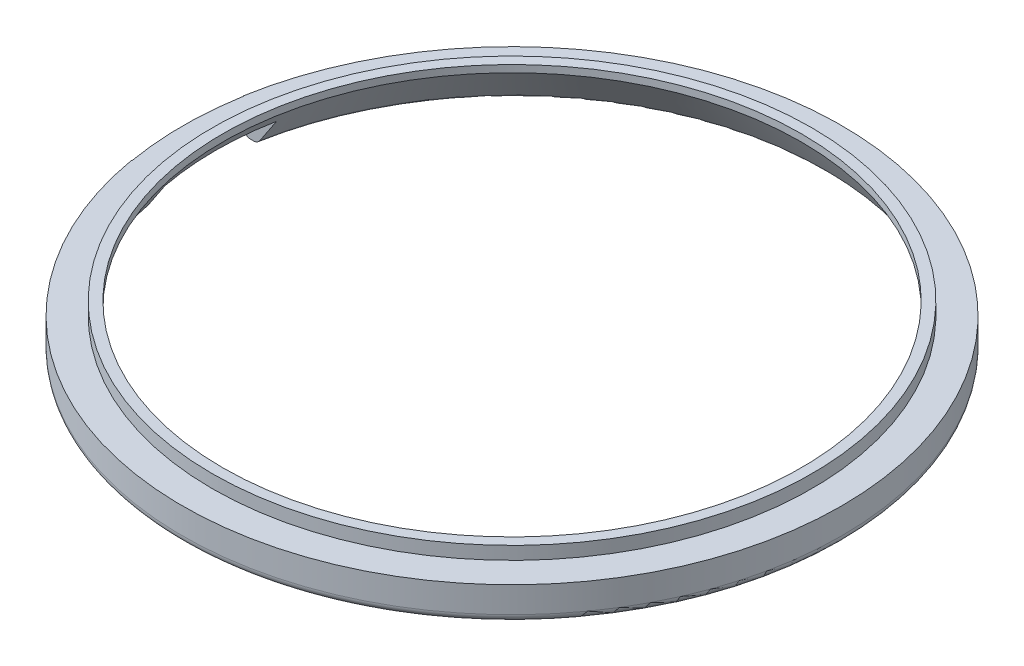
ISO-10303-21;
HEADER;
FILE_DESCRIPTION(('STEP AP214'),'2;1');
FILE_NAME('part.step','',(''),(''),'','','');
FILE_SCHEMA(('AUTOMOTIVE_DESIGN { 1 0 10303 214 1 1 1 1 }'));
ENDSEC;
DATA;
#1=APPLICATION_CONTEXT('core data for automotive mechanical design processes');
#2=APPLICATION_PROTOCOL_DEFINITION('international standard','automotive_design',2000,#1);
#3=PRODUCT_CONTEXT('',#1,'mechanical');
#4=PRODUCT('Part','Part','',(#3));
#5=PRODUCT_RELATED_PRODUCT_CATEGORY('part','',(#4));
#6=PRODUCT_DEFINITION_FORMATION('','',#4);
#7=PRODUCT_DEFINITION_CONTEXT('part definition',#1,'design');
#8=PRODUCT_DEFINITION('design','',#6,#7);
#9=PRODUCT_DEFINITION_SHAPE('','',#8);
#10=(LENGTH_UNIT() NAMED_UNIT(*) SI_UNIT(.MILLI.,.METRE.));
#11=(NAMED_UNIT(*) PLANE_ANGLE_UNIT() SI_UNIT($,.RADIAN.));
#12=(NAMED_UNIT(*) SI_UNIT($,.STERADIAN.) SOLID_ANGLE_UNIT());
#13=UNCERTAINTY_MEASURE_WITH_UNIT(LENGTH_MEASURE(1.E-05),#10,'distance_accuracy_value','');
#14=(GEOMETRIC_REPRESENTATION_CONTEXT(3) GLOBAL_UNCERTAINTY_ASSIGNED_CONTEXT((#13)) GLOBAL_UNIT_ASSIGNED_CONTEXT((#10,
#11,#12)) REPRESENTATION_CONTEXT('',''));
#15=CARTESIAN_POINT('',(0.,0.,0.));
#16=DIRECTION('',(0.,0.,1.));
#17=DIRECTION('',(1.,0.,0.));
#18=AXIS2_PLACEMENT_3D('',#15,#16,#17);
#19=CARTESIAN_POINT('',(0.,1.8,0.));
#20=DIRECTION('',(0.,1.,0.));
#21=DIRECTION('',(0.,0.,1.));
#22=AXIS2_PLACEMENT_3D('',#19,#20,#21);
#23=PLANE('',#22);
#24=CARTESIAN_POINT('',(0.,1.8,0.));
#25=DIRECTION('',(0.,1.,0.));
#26=DIRECTION('',(0.,0.,1.));
#27=AXIS2_PLACEMENT_3D('',#24,#25,#26);
#28=CIRCLE('',#27,11.15);
#29=CARTESIAN_POINT('',(0.,1.8,11.15));
#30=VERTEX_POINT('',#29);
#31=EDGE_CURVE('E248',#30,#30,#28,.T.);
#32=ORIENTED_EDGE('',*,*,#31,.F.);
#33=EDGE_LOOP('',(#32));
#34=FACE_BOUND('',#33,.T.);
#35=CARTESIAN_POINT('',(0.,1.8,0.));
#36=DIRECTION('',(0.,1.,0.));
#37=DIRECTION('',(0.,0.,1.));
#38=AXIS2_PLACEMENT_3D('',#35,#36,#37);
#39=CIRCLE('',#38,11.55);
#40=CARTESIAN_POINT('',(0.,1.8,11.55));
#41=VERTEX_POINT('',#40);
#42=EDGE_CURVE('E341',#41,#41,#39,.T.);
#43=ORIENTED_EDGE('',*,*,#42,.T.);
#44=EDGE_LOOP('',(#43));
#45=FACE_BOUND('',#44,.T.);
#46=ADVANCED_FACE('F34',(#34,#45),#23,.T.);
#47=CARTESIAN_POINT('',(0.,1.8,0.));
#48=DIRECTION('',(0.,-1.,0.));
#49=DIRECTION('',(0.,0.,-1.));
#50=AXIS2_PLACEMENT_3D('',#47,#48,#49);
#51=CYLINDRICAL_SURFACE('',#50,12.7);
#52=CARTESIAN_POINT('',(0.,1.3,0.));
#53=DIRECTION('',(0.,1.,0.));
#54=DIRECTION('',(0.,0.,1.));
#55=AXIS2_PLACEMENT_3D('',#52,#53,#54);
#56=CIRCLE('',#55,12.7);
#57=CARTESIAN_POINT('',(-12.516688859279,1.3,2.15));
#58=VERTEX_POINT('',#57);
#59=CARTESIAN_POINT('',(-12.516688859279,1.3,-2.15));
#60=VERTEX_POINT('',#59);
#61=EDGE_CURVE('E254',#58,#60,#56,.T.);
#62=ORIENTED_EDGE('',*,*,#61,.F.);
#63=DIRECTION('',(0.,-1.,0.));
#64=VECTOR('',#63,1.);
#65=CARTESIAN_POINT('',(-12.516688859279,1.8,2.15));
#66=LINE('',#65,#64);
#67=CARTESIAN_POINT('',(-12.516688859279,0.3,2.15));
#68=VERTEX_POINT('',#67);
#69=EDGE_CURVE('E111',#58,#68,#66,.T.);
#70=ORIENTED_EDGE('',*,*,#69,.T.);
#71=CARTESIAN_POINT('',(0.,0.3,0.));
#72=DIRECTION('',(0.,1.,0.));
#73=DIRECTION('',(0.,0.,1.));
#74=AXIS2_PLACEMENT_3D('',#71,#72,#73);
#75=CIRCLE('',#74,12.7);
#76=CARTESIAN_POINT('',(-12.516688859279,0.3,-2.15));
#77=VERTEX_POINT('',#76);
#78=EDGE_CURVE('E173',#68,#77,#75,.T.);
#79=ORIENTED_EDGE('',*,*,#78,.T.);
#80=DIRECTION('',(0.,-1.,0.));
#81=VECTOR('',#80,1.);
#82=CARTESIAN_POINT('',(-12.516688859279,1.8,-2.15));
#83=LINE('',#82,#81);
#84=EDGE_CURVE('E245',#77,#60,#83,.F.);
#85=ORIENTED_EDGE('',*,*,#84,.T.);
#86=EDGE_LOOP('',(#62,#70,#79,#85));
#87=FACE_BOUND('',#86,.T.);
#88=ADVANCED_FACE('F138',(#87),#51,.T.);
#89=CARTESIAN_POINT('',(-12.7,0.,-2.15));
#90=DIRECTION('',(0.,0.,-1.));
#91=DIRECTION('',(0.,1.,0.));
#92=AXIS2_PLACEMENT_3D('',#89,#90,#91);
#93=PLANE('',#92);
#94=DIRECTION('',(1.,0.,0.));
#95=VECTOR('',#94,1.);
#96=CARTESIAN_POINT('',(-12.7,1.3,-2.15));
#97=LINE('',#96,#95);
#98=CARTESIAN_POINT('',(-12.4992799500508,1.29999999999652,-2.15));
#99=VERTEX_POINT('',#98);
#100=EDGE_CURVE('E50',#60,#99,#97,.T.);
#101=ORIENTED_EDGE('',*,*,#100,.F.);
#102=ORIENTED_EDGE('',*,*,#84,.F.);
#103=CARTESIAN_POINT('',(-12.516688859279,0.3,-2.15));
#104=CARTESIAN_POINT('',(-12.516704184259,0.283300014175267,-2.15));
#105=CARTESIAN_POINT('',(-12.51527494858,0.266605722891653,-2.15));
#106=CARTESIAN_POINT('',(-12.5096421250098,0.233711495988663,-2.15));
#107=CARTESIAN_POINT('',(-12.5054418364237,0.217510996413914,-2.15));
#108=CARTESIAN_POINT('',(-12.4943792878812,0.186040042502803,-2.15));
#109=CARTESIAN_POINT('',(-12.4875161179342,0.170769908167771,-2.15));
#110=CARTESIAN_POINT('',(-12.4713406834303,0.141589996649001,-2.15));
#111=CARTESIAN_POINT('',(-12.4620285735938,0.127680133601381,-2.15));
#112=CARTESIAN_POINT('',(-12.4411637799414,0.101515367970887,-2.15));
#113=CARTESIAN_POINT('',(-12.4295975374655,0.0892712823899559,-2.15));
#114=CARTESIAN_POINT('',(-12.4045962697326,0.0668646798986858,-2.15));
#115=CARTESIAN_POINT('',(-12.3911608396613,0.0567026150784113,-2.15));
#116=CARTESIAN_POINT('',(-12.3626072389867,0.0386007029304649,-2.15));
#117=CARTESIAN_POINT('',(-12.3474683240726,0.0306936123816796,-2.15));
#118=CARTESIAN_POINT('',(-12.3160921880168,0.0174974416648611,-2.15));
#119=CARTESIAN_POINT('',(-12.2998553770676,0.0122073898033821,-2.15));
#120=CARTESIAN_POINT('',(-12.2716532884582,0.00553607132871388,-2.15));
#121=CARTESIAN_POINT('',(-12.2598470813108,0.00346117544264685,-2.15));
#122=CARTESIAN_POINT('',(-12.2360908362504,0.000693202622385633,-2.15));
#123=CARTESIAN_POINT('',(-12.224141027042,-1.83742113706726E-06,-2.15));
#124=CARTESIAN_POINT('',(-12.212186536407,0.,-2.15));
#125=B_SPLINE_CURVE_WITH_KNOTS('',3,(#103,#104,#105,#106,#107,#108,#109,#110,#111,#112,#113,
#114,#115,#116,#117,#118,#119,#120,#121,#122,#123,#124),.UNSPECIFIED.,.F.,.F.,(4,2,2,2,2,2,2,2,
2,2,4),(0.,0.0500304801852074,0.10000149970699,0.149989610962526,0.199974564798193,
0.250270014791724,0.300576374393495,0.351580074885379,0.402564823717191,0.438450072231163,
0.474284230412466),.UNSPECIFIED.);
#126=CARTESIAN_POINT('',(-12.212186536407,0.,-2.15));
#127=VERTEX_POINT('',#126);
#128=EDGE_CURVE('E148',#77,#127,#125,.T.);
#129=ORIENTED_EDGE('',*,*,#128,.T.);
#130=DIRECTION('',(1.,0.,0.));
#131=VECTOR('',#130,1.);
#132=CARTESIAN_POINT('',(-12.7,0.,-2.15));
#133=LINE('',#132,#131);
#134=CARTESIAN_POINT('',(-12.1228641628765,0.,-2.15));
#135=VERTEX_POINT('',#134);
#136=EDGE_CURVE('E202',#127,#135,#133,.T.);
#137=ORIENTED_EDGE('',*,*,#136,.T.);
#138=CARTESIAN_POINT('',(-12.1228641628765,0.,-2.15));
#139=CARTESIAN_POINT('',(-12.1055158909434,-1.3442783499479E-05,-2.15));
#140=CARTESIAN_POINT('',(-12.0881703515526,0.00145816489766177,-2.15));
#141=CARTESIAN_POINT('',(-12.0539781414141,0.0072722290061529,-2.15));
#142=CARTESIAN_POINT('',(-12.0371311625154,0.0116128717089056,-2.15));
#143=CARTESIAN_POINT('',(-12.0043912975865,0.0230712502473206,-2.15));
#144=CARTESIAN_POINT('',(-11.9884993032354,0.0301915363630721,-2.15));
#145=CARTESIAN_POINT('',(-11.9581547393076,0.0470129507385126,-2.15));
#146=CARTESIAN_POINT('',(-11.9437013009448,0.056712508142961,-2.15));
#147=CARTESIAN_POINT('',(-11.9181712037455,0.0772170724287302,-2.15));
#148=CARTESIAN_POINT('',(-11.9068977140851,0.0877780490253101,-2.15));
#149=CARTESIAN_POINT('',(-11.8860743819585,0.110503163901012,-2.15));
#150=CARTESIAN_POINT('',(-11.8765266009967,0.122669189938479,-2.15));
#151=CARTESIAN_POINT('',(-11.8679798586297,0.135512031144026,-2.15));
#152=B_SPLINE_CURVE_WITH_KNOTS('',3,(#138,#139,#140,#141,#142,#143,#144,#145,#146,#147,#148,
#149,#150,#151),.UNSPECIFIED.,.F.,.F.,(4,2,2,2,2,2,4),(0.,0.051979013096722,0.103925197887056,
0.155919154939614,0.207881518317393,0.25404713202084,0.300267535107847),.UNSPECIFIED.);
#153=CARTESIAN_POINT('',(-11.8679798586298,0.13551203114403,-2.15));
#154=VERTEX_POINT('',#153);
#155=EDGE_CURVE('E168',#135,#154,#152,.T.);
#156=ORIENTED_EDGE('',*,*,#155,.T.);
#157=CARTESIAN_POINT('',(-13.5695185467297,-2.42330652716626,-2.15));
#158=CARTESIAN_POINT('',(-13.2928045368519,-2.00645330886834,-2.15));
#159=CARTESIAN_POINT('',(-13.0159518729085,-1.58969205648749,-2.15));
#160=CARTESIAN_POINT('',(-12.4618982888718,-0.756401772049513,-2.15));
#161=CARTESIAN_POINT('',(-12.1846973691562,-0.339872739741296,-2.15));
#162=CARTESIAN_POINT('',(-11.6298756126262,0.492905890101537,-2.15));
#163=CARTESIAN_POINT('',(-11.3522547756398,0.909155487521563,-2.15));
#164=CARTESIAN_POINT('',(-10.7964844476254,1.74130222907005,-2.15));
#165=CARTESIAN_POINT('',(-10.5183349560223,2.15719937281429,-2.15));
#166=CARTESIAN_POINT('',(-10.2398670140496,2.57288341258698,-2.15));
#167=B_SPLINE_CURVE_WITH_KNOTS('',3,(#157,#158,#159,#160,#161,#162,#163,#164,#165,#166),
.UNSPECIFIED.,.F.,.F.,(4,2,2,2,4),(0.,1.50101146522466,3.00202130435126,4.50303175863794,
6.00404384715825),.UNSPECIFIED.);
#168=CARTESIAN_POINT('',(-11.2247566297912,1.1,-2.15));
#169=VERTEX_POINT('',#168);
#170=EDGE_CURVE('E189',#154,#169,#167,.T.);
#171=ORIENTED_EDGE('',*,*,#170,.T.);
#172=DIRECTION('',(1.,0.,0.));
#173=VECTOR('',#172,1.);
#174=CARTESIAN_POINT('',(-12.7,1.1,-2.15));
#175=LINE('',#174,#173);
#176=CARTESIAN_POINT('',(-12.212186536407,1.1,-2.15));
#177=VERTEX_POINT('',#176);
#178=EDGE_CURVE('E196',#177,#169,#175,.T.);
#179=ORIENTED_EDGE('',*,*,#178,.F.);
#180=CARTESIAN_POINT('',(-12.212186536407,1.1,-2.15));
#181=CARTESIAN_POINT('',(-12.2295086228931,1.09998650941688,-2.15));
#182=CARTESIAN_POINT('',(-12.2468281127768,1.10145441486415,-2.15));
#183=CARTESIAN_POINT('',(-12.2809746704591,1.10725666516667,-2.15));
#184=CARTESIAN_POINT('',(-12.2978018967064,1.11159007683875,-2.15));
#185=CARTESIAN_POINT('',(-12.3304991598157,1.12303079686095,-2.15));
#186=CARTESIAN_POINT('',(-12.3463685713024,1.1301398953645,-2.15));
#187=CARTESIAN_POINT('',(-12.3766724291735,1.14693780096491,-2.15));
#188=CARTESIAN_POINT('',(-12.3911073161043,1.15662581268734,-2.15));
#189=CARTESIAN_POINT('',(-12.4180177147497,1.17824052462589,-2.15));
#190=CARTESIAN_POINT('',(-12.4305067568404,1.19015037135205,-2.15));
#191=CARTESIAN_POINT('',(-12.4532757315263,1.21592791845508,-2.15));
#192=CARTESIAN_POINT('',(-12.4635552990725,1.22979594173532,-2.15));
#193=CARTESIAN_POINT('',(-12.4814553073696,1.25888345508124,-2.15));
#194=CARTESIAN_POINT('',(-12.4891109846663,1.27408128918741,-2.15));
#195=CARTESIAN_POINT('',(-12.5017191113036,1.30555394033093,-2.15));
#196=CARTESIAN_POINT('',(-12.5066737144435,1.32182788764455,-2.15));
#197=CARTESIAN_POINT('',(-12.5123578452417,1.34851963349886,-2.15));
#198=CARTESIAN_POINT('',(-12.5139810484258,1.35875550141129,-2.15));
#199=CARTESIAN_POINT('',(-12.5161462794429,1.37932600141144,-2.15));
#200=CARTESIAN_POINT('',(-12.5166898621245,1.38966046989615,-2.15));
#201=CARTESIAN_POINT('',(-12.5166888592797,1.39999999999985,-2.15));
#202=B_SPLINE_CURVE_WITH_KNOTS('',3,(#180,#181,#182,#183,#184,#185,#186,#187,#188,#189,#190,
#191,#192,#193,#194,#195,#196,#197,#198,#199,#200,#201),.UNSPECIFIED.,.F.,.F.,(4,2,2,2,2,2,2,2,
2,2,4),(0.,0.0519007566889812,0.103784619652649,0.155702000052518,0.207603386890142,
0.259126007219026,0.31065713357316,0.361466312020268,0.412234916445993,0.443274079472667,
0.47426850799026),.UNSPECIFIED.);
#203=EDGE_CURVE('E43',#177,#99,#202,.T.);
#204=ORIENTED_EDGE('',*,*,#203,.T.);
#205=EDGE_LOOP('',(#101,#102,#129,#137,#156,#171,#179,#204));
#206=FACE_BOUND('',#205,.T.);
#207=ADVANCED_FACE('F179',(#206),#93,.F.);
#208=CARTESIAN_POINT('',(-12.7,0.,2.15));
#209=DIRECTION('',(0.,0.,1.));
#210=DIRECTION('',(0.,-1.,0.));
#211=AXIS2_PLACEMENT_3D('',#208,#209,#210);
#212=PLANE('',#211);
#213=DIRECTION('',(-1.,0.,0.));
#214=VECTOR('',#213,1.);
#215=CARTESIAN_POINT('',(-12.7,1.3,2.15));
#216=LINE('',#215,#214);
#217=CARTESIAN_POINT('',(-12.4992799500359,1.3,2.15));
#218=VERTEX_POINT('',#217);
#219=EDGE_CURVE('E99',#218,#58,#216,.T.);
#220=ORIENTED_EDGE('',*,*,#219,.F.);
#221=CARTESIAN_POINT('',(-12.516688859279,1.4,2.15));
#222=CARTESIAN_POINT('',(-12.516704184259,1.38330001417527,2.15));
#223=CARTESIAN_POINT('',(-12.51527494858,1.36660572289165,2.15));
#224=CARTESIAN_POINT('',(-12.5096421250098,1.33371149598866,2.15));
#225=CARTESIAN_POINT('',(-12.5054418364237,1.31751099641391,2.15));
#226=CARTESIAN_POINT('',(-12.4943792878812,1.2860400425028,2.15));
#227=CARTESIAN_POINT('',(-12.4875161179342,1.27076990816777,2.15));
#228=CARTESIAN_POINT('',(-12.4713406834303,1.241589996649,2.15));
#229=CARTESIAN_POINT('',(-12.4620285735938,1.22768013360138,2.15));
#230=CARTESIAN_POINT('',(-12.4411637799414,1.20151536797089,2.15));
#231=CARTESIAN_POINT('',(-12.4295975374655,1.18927128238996,2.15));
#232=CARTESIAN_POINT('',(-12.4045962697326,1.16686467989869,2.15));
#233=CARTESIAN_POINT('',(-12.3911608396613,1.15670261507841,2.15));
#234=CARTESIAN_POINT('',(-12.3626072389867,1.13860070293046,2.15));
#235=CARTESIAN_POINT('',(-12.3474683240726,1.13069361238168,2.15));
#236=CARTESIAN_POINT('',(-12.3160921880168,1.11749744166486,2.15));
#237=CARTESIAN_POINT('',(-12.2998553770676,1.11220738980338,2.15));
#238=CARTESIAN_POINT('',(-12.2716532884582,1.10553607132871,2.15));
#239=CARTESIAN_POINT('',(-12.2598470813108,1.10346117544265,2.15));
#240=CARTESIAN_POINT('',(-12.2360908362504,1.10069320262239,2.15));
#241=CARTESIAN_POINT('',(-12.224141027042,1.09999816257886,2.15));
#242=CARTESIAN_POINT('',(-12.212186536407,1.1,2.15));
#243=B_SPLINE_CURVE_WITH_KNOTS('',3,(#221,#222,#223,#224,#225,#226,#227,#228,#229,#230,#231,
#232,#233,#234,#235,#236,#237,#238,#239,#240,#241,#242),.UNSPECIFIED.,.F.,.F.,(4,2,2,2,2,2,2,2,
2,2,4),(0.,0.050030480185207,0.100001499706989,0.149989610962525,0.199974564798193,
0.250270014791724,0.300576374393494,0.351580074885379,0.402564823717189,0.438450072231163,
0.474284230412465),.UNSPECIFIED.);
#244=CARTESIAN_POINT('',(-12.212186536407,1.1,2.15));
#245=VERTEX_POINT('',#244);
#246=EDGE_CURVE('E108',#218,#245,#243,.T.);
#247=ORIENTED_EDGE('',*,*,#246,.T.);
#248=DIRECTION('',(1.,0.,0.));
#249=VECTOR('',#248,1.);
#250=CARTESIAN_POINT('',(-12.7,1.1,2.15));
#251=LINE('',#250,#249);
#252=CARTESIAN_POINT('',(-11.2247566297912,1.1,2.15));
#253=VERTEX_POINT('',#252);
#254=EDGE_CURVE('E239',#245,#253,#251,.T.);
#255=ORIENTED_EDGE('',*,*,#254,.T.);
#256=CARTESIAN_POINT('',(-10.2398670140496,2.57288341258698,2.15));
#257=CARTESIAN_POINT('',(-10.5183349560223,2.15719937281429,2.15));
#258=CARTESIAN_POINT('',(-10.7964844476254,1.74130222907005,2.15));
#259=CARTESIAN_POINT('',(-11.3522547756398,0.909155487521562,2.15));
#260=CARTESIAN_POINT('',(-11.6298756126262,0.492905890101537,2.15));
#261=CARTESIAN_POINT('',(-12.1846973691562,-0.339872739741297,2.15));
#262=CARTESIAN_POINT('',(-12.4618982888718,-0.756401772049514,2.15));
#263=CARTESIAN_POINT('',(-13.0159518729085,-1.5896920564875,2.15));
#264=CARTESIAN_POINT('',(-13.2928045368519,-2.00645330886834,2.15));
#265=CARTESIAN_POINT('',(-13.5695185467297,-2.42330652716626,2.15));
#266=B_SPLINE_CURVE_WITH_KNOTS('',3,(#256,#257,#258,#259,#260,#261,#262,#263,#264,#265),
.UNSPECIFIED.,.F.,.F.,(4,2,2,2,4),(0.,1.50101208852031,3.00202254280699,4.50303238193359,
6.00404384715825),.UNSPECIFIED.);
#267=CARTESIAN_POINT('',(-11.8679798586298,0.135512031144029,2.15));
#268=VERTEX_POINT('',#267);
#269=EDGE_CURVE('E197',#253,#268,#266,.T.);
#270=ORIENTED_EDGE('',*,*,#269,.T.);
#271=CARTESIAN_POINT('',(-11.8679798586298,0.135512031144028,2.15000000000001));
#272=CARTESIAN_POINT('',(-11.8774356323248,0.121294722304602,2.15));
#273=CARTESIAN_POINT('',(-11.8881241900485,0.107909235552,2.15));
#274=CARTESIAN_POINT('',(-11.9115747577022,0.0831475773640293,2.15));
#275=CARTESIAN_POINT('',(-11.9243325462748,0.0717674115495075,2.15));
#276=CARTESIAN_POINT('',(-11.9515753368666,0.0512985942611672,2.15));
#277=CARTESIAN_POINT('',(-11.9660609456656,0.0422107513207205,2.15));
#278=CARTESIAN_POINT('',(-11.9963415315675,0.0265620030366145,2.15));
#279=CARTESIAN_POINT('',(-12.0121367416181,0.0200015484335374,2.15));
#280=CARTESIAN_POINT('',(-12.0436011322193,0.00989858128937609,2.15));
#281=CARTESIAN_POINT('',(-12.0592194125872,0.00619661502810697,2.15));
#282=CARTESIAN_POINT('',(-12.0908452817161,0.00124232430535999,2.15));
#283=CARTESIAN_POINT('',(-12.1068530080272,-9.12154720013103E-06,2.15));
#284=CARTESIAN_POINT('',(-12.1228641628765,0.,2.15));
#285=B_SPLINE_CURVE_WITH_KNOTS('',3,(#271,#272,#273,#274,#275,#276,#277,#278,#279,#280,#281,
#282,#283,#284),.UNSPECIFIED.,.F.,.F.,(4,2,2,2,2,2,4),(0.,0.0511479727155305,0.102192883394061,
0.153255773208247,0.20432776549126,0.252289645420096,0.300268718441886),.UNSPECIFIED.);
#286=CARTESIAN_POINT('',(-12.1228641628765,0.,2.15));
#287=VERTEX_POINT('',#286);
#288=EDGE_CURVE('E57',#268,#287,#285,.T.);
#289=ORIENTED_EDGE('',*,*,#288,.T.);
#290=DIRECTION('',(1.,0.,0.));
#291=VECTOR('',#290,1.);
#292=CARTESIAN_POINT('',(-12.7,0.,2.15));
#293=LINE('',#292,#291);
#294=CARTESIAN_POINT('',(-12.212186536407,0.,2.15));
#295=VERTEX_POINT('',#294);
#296=EDGE_CURVE('E234',#295,#287,#293,.T.);
#297=ORIENTED_EDGE('',*,*,#296,.F.);
#298=CARTESIAN_POINT('',(-12.212186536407,0.,2.15));
#299=CARTESIAN_POINT('',(-12.2295086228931,-1.3490583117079E-05,2.15));
#300=CARTESIAN_POINT('',(-12.2468281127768,0.00145441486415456,2.15));
#301=CARTESIAN_POINT('',(-12.2809746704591,0.00725666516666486,2.15));
#302=CARTESIAN_POINT('',(-12.2978018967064,0.0115900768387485,2.15));
#303=CARTESIAN_POINT('',(-12.3304991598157,0.0230307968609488,2.15));
#304=CARTESIAN_POINT('',(-12.3463685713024,0.0301398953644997,2.15));
#305=CARTESIAN_POINT('',(-12.3766724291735,0.0469378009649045,2.15));
#306=CARTESIAN_POINT('',(-12.3911073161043,0.0566258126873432,2.15));
#307=CARTESIAN_POINT('',(-12.4180177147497,0.0782405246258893,2.15));
#308=CARTESIAN_POINT('',(-12.4305067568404,0.0901503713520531,2.15));
#309=CARTESIAN_POINT('',(-12.4532757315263,0.115927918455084,2.15));
#310=CARTESIAN_POINT('',(-12.4635552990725,0.129795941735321,2.15));
#311=CARTESIAN_POINT('',(-12.4814553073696,0.158883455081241,2.15));
#312=CARTESIAN_POINT('',(-12.4891109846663,0.174081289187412,2.15));
#313=CARTESIAN_POINT('',(-12.5017191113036,0.205553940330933,2.15));
#314=CARTESIAN_POINT('',(-12.5066737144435,0.221827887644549,2.15));
#315=CARTESIAN_POINT('',(-12.5123578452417,0.24851963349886,2.15));
#316=CARTESIAN_POINT('',(-12.5139810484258,0.258755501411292,2.15));
#317=CARTESIAN_POINT('',(-12.5161462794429,0.279326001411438,2.15));
#318=CARTESIAN_POINT('',(-12.5166898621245,0.289660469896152,2.15));
#319=CARTESIAN_POINT('',(-12.5166888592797,0.299999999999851,2.15));
#320=B_SPLINE_CURVE_WITH_KNOTS('',3,(#298,#299,#300,#301,#302,#303,#304,#305,#306,#307,#308,
#309,#310,#311,#312,#313,#314,#315,#316,#317,#318,#319),.UNSPECIFIED.,.F.,.F.,(4,2,2,2,2,2,2,2,
2,2,4),(0.,0.0519007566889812,0.103784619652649,0.155702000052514,0.207603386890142,
0.259126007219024,0.31065713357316,0.361466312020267,0.412234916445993,0.443274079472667,
0.47426850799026),.UNSPECIFIED.);
#321=EDGE_CURVE('E119',#295,#68,#320,.T.);
#322=ORIENTED_EDGE('',*,*,#321,.T.);
#323=ORIENTED_EDGE('',*,*,#69,.F.);
#324=EDGE_LOOP('',(#220,#247,#255,#270,#289,#297,#322,#323));
#325=FACE_BOUND('',#324,.T.);
#326=ADVANCED_FACE('F107',(#325),#212,.F.);
#327=CARTESIAN_POINT('',(0.,1.4,0.));
#328=DIRECTION('',(0.,1.,0.));
#329=DIRECTION('',(0.,0.,1.));
#330=AXIS2_PLACEMENT_3D('',#327,#328,#329);
#331=TOROIDAL_SURFACE('',#330,12.4,0.3);
#332=ORIENTED_EDGE('',*,*,#246,.F.);
#333=CARTESIAN_POINT('',(0.,1.3,0.));
#334=DIRECTION('',(0.,1.,0.));
#335=DIRECTION('',(0.,0.,1.));
#336=AXIS2_PLACEMENT_3D('',#333,#334,#335);
#337=CIRCLE('',#336,12.6828427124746);
#338=EDGE_CURVE('E12',#218,#99,#337,.F.);
#339=ORIENTED_EDGE('',*,*,#338,.T.);
#340=ORIENTED_EDGE('',*,*,#203,.F.);
#341=CARTESIAN_POINT('',(0.,1.1,0.));
#342=DIRECTION('',(0.,1.,0.));
#343=DIRECTION('',(0.,0.,1.));
#344=AXIS2_PLACEMENT_3D('',#341,#342,#343);
#345=CIRCLE('',#344,12.4);
#346=EDGE_CURVE('E116',#245,#177,#345,.F.);
#347=ORIENTED_EDGE('',*,*,#346,.F.);
#348=EDGE_LOOP('',(#332,#339,#340,#347));
#349=FACE_BOUND('',#348,.T.);
#350=ADVANCED_FACE('F115',(#349),#331,.T.);
#351=CARTESIAN_POINT('',(0.,0.,0.));
#352=DIRECTION('',(0.,1.,0.));
#353=DIRECTION('',(0.,0.,1.));
#354=AXIS2_PLACEMENT_3D('',#351,#352,#353);
#355=PLANE('',#354);
#356=ORIENTED_EDGE('',*,*,#136,.F.);
#357=CARTESIAN_POINT('',(0.,0.,0.));
#358=DIRECTION('',(0.,1.,0.));
#359=DIRECTION('',(0.,0.,1.));
#360=AXIS2_PLACEMENT_3D('',#357,#358,#359);
#361=CIRCLE('',#360,12.4);
#362=EDGE_CURVE('E162',#127,#295,#361,.F.);
#363=ORIENTED_EDGE('',*,*,#362,.T.);
#364=ORIENTED_EDGE('',*,*,#296,.T.);
#365=CARTESIAN_POINT('',(0.,0.,0.));
#366=DIRECTION('',(0.,1.,0.));
#367=DIRECTION('',(0.,0.,1.));
#368=AXIS2_PLACEMENT_3D('',#365,#366,#367);
#369=CIRCLE('',#368,12.312040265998);
#370=EDGE_CURVE('E163',#287,#135,#369,.T.);
#371=ORIENTED_EDGE('',*,*,#370,.T.);
#372=EDGE_LOOP('',(#356,#363,#364,#371));
#373=FACE_BOUND('',#372,.T.);
#374=ADVANCED_FACE('F137',(#373),#355,.F.);
#375=CARTESIAN_POINT('',(0.,1.8,0.));
#376=DIRECTION('',(0.,-1.,0.));
#377=DIRECTION('',(0.,0.,-1.));
#378=AXIS2_PLACEMENT_3D('',#375,#376,#377);
#379=CYLINDRICAL_SURFACE('',#378,11.15);
#380=CARTESIAN_POINT('',(0.,1.52525347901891,0.));
#381=DIRECTION('',(0.,-1.,0.));
#382=DIRECTION('',(0.,0.,-1.));
#383=AXIS2_PLACEMENT_3D('',#380,#381,#382);
#384=CIRCLE('',#383,11.15);
#385=CARTESIAN_POINT('',(0.,1.52525347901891,-11.15));
#386=VERTEX_POINT('',#385);
#387=EDGE_CURVE('E256',#386,#386,#384,.T.);
#388=ORIENTED_EDGE('',*,*,#387,.T.);
#389=EDGE_LOOP('',(#388));
#390=FACE_BOUND('',#389,.T.);
#391=ORIENTED_EDGE('',*,*,#31,.T.);
#392=EDGE_LOOP('',(#391));
#393=FACE_BOUND('',#392,.T.);
#394=ADVANCED_FACE('F184',(#390,#393),#379,.F.);
#395=CARTESIAN_POINT('',(-12.7,1.1,-2.15));
#396=DIRECTION('',(0.,1.,0.));
#397=DIRECTION('',(0.,0.,1.));
#398=AXIS2_PLACEMENT_3D('',#395,#396,#397);
#399=PLANE('',#398);
#400=ORIENTED_EDGE('',*,*,#254,.F.);
#401=ORIENTED_EDGE('',*,*,#346,.T.);
#402=ORIENTED_EDGE('',*,*,#178,.T.);
#403=CARTESIAN_POINT('',(0.,1.1,0.));
#404=DIRECTION('',(0.,1.,0.));
#405=DIRECTION('',(0.,0.,1.));
#406=AXIS2_PLACEMENT_3D('',#403,#404,#405);
#407=CIRCLE('',#406,11.4288083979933);
#408=EDGE_CURVE('E251',#169,#253,#407,.T.);
#409=ORIENTED_EDGE('',*,*,#408,.T.);
#410=EDGE_LOOP('',(#400,#401,#402,#409));
#411=FACE_BOUND('',#410,.T.);
#412=ADVANCED_FACE('F183',(#411),#399,.F.);
#413=CARTESIAN_POINT('',(0.,0.,0.));
#414=DIRECTION('',(0.,-1.,0.));
#415=DIRECTION('',(0.,0.,-1.));
#416=AXIS2_PLACEMENT_3D('',#413,#414,#415);
#417=CONICAL_SURFACE('',#416,12.15,0.580321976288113);
#418=ORIENTED_EDGE('',*,*,#387,.F.);
#419=EDGE_LOOP('',(#418));
#420=FACE_BOUND('',#419,.T.);
#421=ORIENTED_EDGE('',*,*,#170,.F.);
#422=CARTESIAN_POINT('',(0.,0.135512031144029,0.));
#423=DIRECTION('',(0.,1.,0.));
#424=DIRECTION('',(0.,0.,1.));
#425=AXIS2_PLACEMENT_3D('',#422,#423,#424);
#426=CIRCLE('',#425,12.0611544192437);
#427=EDGE_CURVE('E117',#154,#268,#426,.F.);
#428=ORIENTED_EDGE('',*,*,#427,.T.);
#429=ORIENTED_EDGE('',*,*,#269,.F.);
#430=ORIENTED_EDGE('',*,*,#408,.F.);
#431=EDGE_LOOP('',(#421,#428,#429,#430));
#432=FACE_BOUND('',#431,.T.);
#433=ADVANCED_FACE('F144',(#420,#432),#417,.F.);
#434=CARTESIAN_POINT('',(0.,0.3,0.));
#435=DIRECTION('',(0.,1.,0.));
#436=DIRECTION('',(0.,0.,1.));
#437=AXIS2_PLACEMENT_3D('',#434,#435,#436);
#438=TOROIDAL_SURFACE('',#437,12.4,0.3);
#439=ORIENTED_EDGE('',*,*,#321,.F.);
#440=ORIENTED_EDGE('',*,*,#362,.F.);
#441=ORIENTED_EDGE('',*,*,#128,.F.);
#442=ORIENTED_EDGE('',*,*,#78,.F.);
#443=EDGE_LOOP('',(#439,#440,#441,#442));
#444=FACE_BOUND('',#443,.T.);
#445=ADVANCED_FACE('F140',(#444),#438,.T.);
#446=CARTESIAN_POINT('',(0.,0.3,0.));
#447=DIRECTION('',(0.,1.,0.));
#448=DIRECTION('',(0.,0.,1.));
#449=AXIS2_PLACEMENT_3D('',#446,#447,#448);
#450=TOROIDAL_SURFACE('',#449,12.312040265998,0.3);
#451=ORIENTED_EDGE('',*,*,#155,.F.);
#452=ORIENTED_EDGE('',*,*,#370,.F.);
#453=ORIENTED_EDGE('',*,*,#288,.F.);
#454=ORIENTED_EDGE('',*,*,#427,.F.);
#455=EDGE_LOOP('',(#451,#452,#453,#454));
#456=FACE_BOUND('',#455,.T.);
#457=ADVANCED_FACE('F36',(#456),#450,.T.);
#458=CARTESIAN_POINT('',(0.,1.3,0.));
#459=DIRECTION('',(0.,1.,0.));
#460=DIRECTION('',(0.,0.,1.));
#461=AXIS2_PLACEMENT_3D('',#458,#459,#460);
#462=PLANE('',#461);
#463=CARTESIAN_POINT('',(0.,1.3,0.));
#464=DIRECTION('',(0.,1.,0.));
#465=DIRECTION('',(0.,0.,1.));
#466=AXIS2_PLACEMENT_3D('',#463,#464,#465);
#467=CIRCLE('',#466,11.55);
#468=CARTESIAN_POINT('',(0.,1.3,11.55));
#469=VERTEX_POINT('',#468);
#470=EDGE_CURVE('E112',#469,#469,#467,.T.);
#471=ORIENTED_EDGE('',*,*,#470,.F.);
#472=EDGE_LOOP('',(#471));
#473=FACE_BOUND('',#472,.T.);
#474=ORIENTED_EDGE('',*,*,#61,.T.);
#475=ORIENTED_EDGE('',*,*,#100,.T.);
#476=ORIENTED_EDGE('',*,*,#338,.F.);
#477=ORIENTED_EDGE('',*,*,#219,.T.);
#478=EDGE_LOOP('',(#474,#475,#476,#477));
#479=FACE_BOUND('',#478,.T.);
#480=ADVANCED_FACE('F98',(#473,#479),#462,.T.);
#481=CARTESIAN_POINT('',(0.,1.3,0.));
#482=DIRECTION('',(0.,1.,0.));
#483=DIRECTION('',(0.,0.,1.));
#484=AXIS2_PLACEMENT_3D('',#481,#482,#483);
#485=CYLINDRICAL_SURFACE('',#484,11.55);
#486=ORIENTED_EDGE('',*,*,#470,.T.);
#487=EDGE_LOOP('',(#486));
#488=FACE_BOUND('',#487,.T.);
#489=ORIENTED_EDGE('',*,*,#42,.F.);
#490=EDGE_LOOP('',(#489));
#491=FACE_BOUND('',#490,.T.);
#492=ADVANCED_FACE('F211',(#488,#491),#485,.T.);
#493=CLOSED_SHELL('',(#46,#88,#207,#326,#350,#374,#394,#412,#433,#445,#457,#480,#492));
#494=MANIFOLD_SOLID_BREP('B2',#493);
#495=ADVANCED_BREP_SHAPE_REPRESENTATION('',(#18,#494),#14);
#496=SHAPE_DEFINITION_REPRESENTATION(#9,#495);
ENDSEC;
END-ISO-10303-21;
